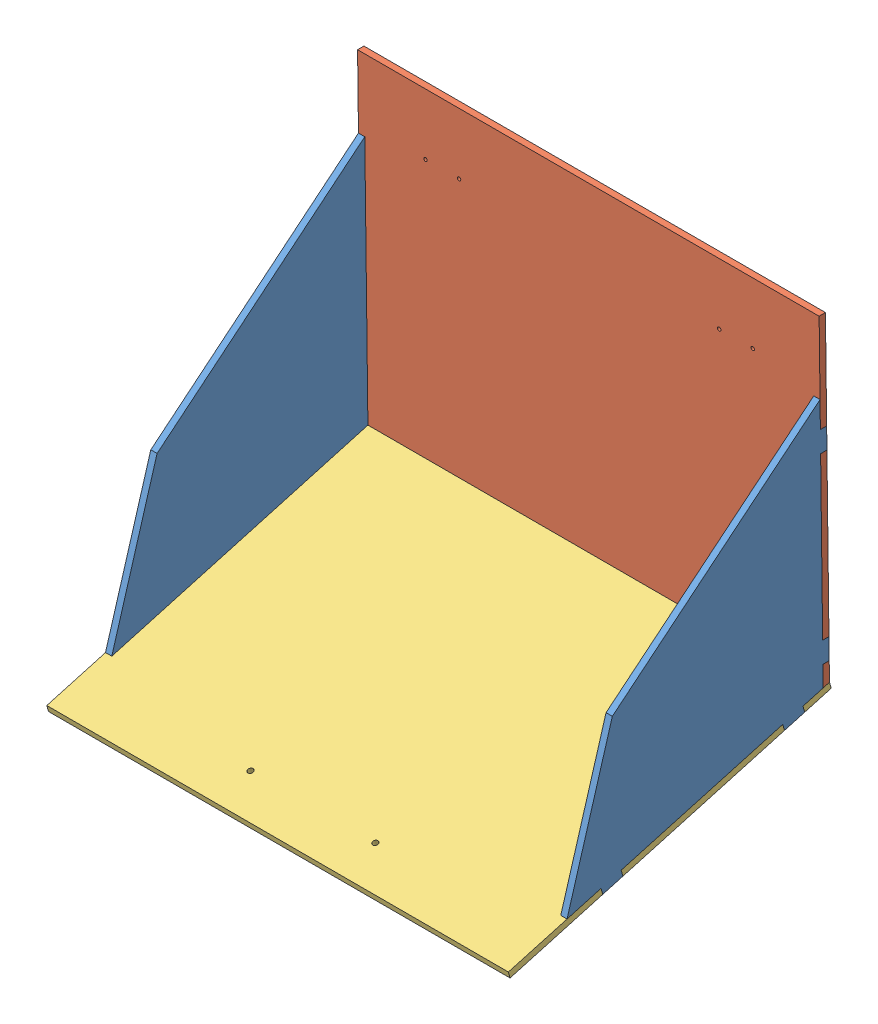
SolidWorks assembly Inkubator_Hood.SLDASM, configuration Standard (file format 6000). Lengths in mm.
Overall size (440 435.96 307.74).
5 component instances, 4 part files, 12 mates.
Components (placement in the parent):
- HoodSide-1: HoodSide.SLDPRT [Standard] at (-285.2126 -52.2055 76.1404) x (0 -0.999922 -0.012474) z (0 -0.012474 0.999922) size (305.26 6 251)
- HoodTop-1: HoodTop.SLDPRT [Standard] at (-65.2126 22.6135 71.0732) x (1 0 0) z (0 -0.999922 -0.012474) size (440 6 309)
- HoodSide-2: HoodSide.SLDPRT [Standard] at (148.7874 -52.2055 76.1404) x (0 -0.999922 -0.012474) z (0 -0.012474 0.999922) size (305.26 6 251)
- HoodFront-1: HoodFront.SLDPRT [Standard] at (-65.2126 -178.9623 220.5627) x (1 0 0) z (0 -0.270848 0.962622) size (440 6 318)
- Grip-1: Grip.SLDPRT [Standard] at (-65.2126 -254.7967 320.2492) x (1 0 0) z (0 -0.962622 -0.270848) size (133 15 46)
Mates (geometry in assembly coordinates):
- Deckungsgleich83: coincident anti-aligned: plane of HoodTop-1 through (148.7874 -92.2024 75.6414) normal (1 0 0); plane of HoodSide-2 through (148.7874 -52.2055 76.1404) normal (-1 0 0)
- Deckungsgleich84: coincident anti-aligned: plane of HoodTop-1 through (154.7874 -112.2009 75.3919) normal (0 0.999922 0.012474); plane of HoodSide-2 through (154.7874 -112.2009 75.3919) normal (0 -0.999922 -0.012474)
- Deckungsgleich85: coincident anti-aligned: plane of HoodTop-1 through (-65.2126 22.5387 77.0728) normal (0 -0.012474 0.999922); plane of HoodSide-2 through (154.7874 62.7855 77.5749) normal (0 0.012474 -0.999922)
- Deckungsgleich86: coincident anti-aligned: plane of HoodSide-1 through (-279.2126 -185.9841 267.6717) normal (0 -0.962622 -0.270848); plane of HoodFront-1 through (-65.2126 -173.1866 222.1878) normal (0 0.962622 0.270848)
- Deckungsgleich87: coincident anti-aligned: plane of HoodSide-1 through (-279.2126 -148.4242 112.027) normal (0 -0.270848 0.962622); plane of HoodFront-1 through (-285.2126 -142.6485 113.6521) normal (0 0.270848 -0.962622)
- Deckungsgleich88: coincident anti-aligned: plane of HoodSide-2 through (148.7874 -52.2055 76.1404) normal (-1 0 0); plane of HoodFront-1 through (148.7874 -137.2315 94.3997) normal (1 0 0)
- Deckungsgleich89: coincident anti-aligned: plane of HoodSide-1 through (-279.2126 -52.2055 76.1404) normal (1 0 0); plane of HoodTop-1 through (-279.2126 -92.2024 75.6414) normal (-1 0 0)
- Deckungsgleich90: coincident anti-aligned: plane of HoodSide-1 through (-279.2126 -92.2024 75.6414) normal (0 0.999922 0.012474); plane of HoodTop-1 through (-285.2126 -92.2024 75.6414) normal (0 -0.999922 -0.012474)
- Deckungsgleich91: coincident anti-aligned: plane of HoodSide-1 through (-279.2126 62.7855 77.5749) normal (0 0.012474 -0.999922); plane of HoodTop-1 through (-65.2126 22.5387 77.0728) normal (0 -0.012474 0.999922)
- Deckungsgleich92: coincident anti-aligned: plane of HoodFront-1 through (-65.2126 -178.9623 220.5627) normal (0 -0.962622 -0.270848); plane of Grip-1 through (-131.7126 -214.5788 347.1475) normal (0 0.962622 0.270848)
- Konzentrisch3: concentric anti-aligned: cylinder of HoodFront-1 through (-5.7126 -206.7717 341.5529) axis (0 -0.962622 -0.270848) radius 2.5; cylinder of Grip-1 through (-5.7126 -222.1736 337.2194) axis (0 0.962622 0.270848) radius 2.0102
- Konzentrisch4: concentric anti-aligned: cylinder of HoodFront-1 through (-124.7126 -206.7717 341.5529) axis (0 -0.962622 -0.270848) radius 2.5; cylinder of Grip-1 through (-124.7126 -222.1736 337.2194) axis (0 0.962622 0.270848) radius 2.0102
